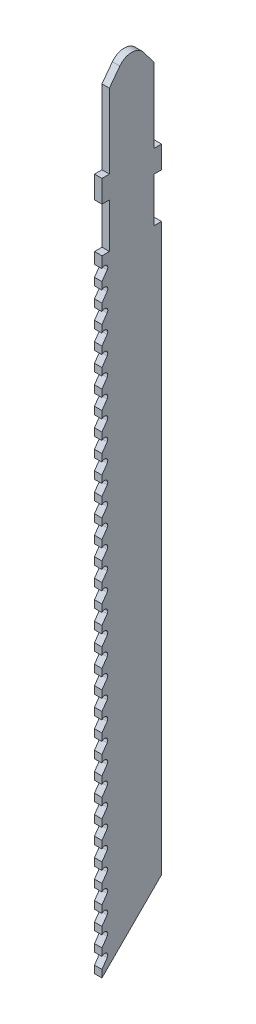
from build123d import *

# Parameters (mm, degrees)
BASE_EXTRUDE_DEPTH      = 0.5
CUT_EXTRUDE1_DEPTH      = 85.096670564
CUT_EXTRUDE1_DEPTH_BACK = 85.096670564
LPATTERN1_COUNT         = 33
LPATTERN1_PITCH         = 2.5


with BuildPart() as part:
    # Sketch1 → Base-Extrude (new, symmetric)
    with BuildSketch(Plane(origin=(0, 0, 0), x_dir=(0, 0, -1), z_dir=(1, 0, 0))):
        with BuildLine():
            Line((3, 0), (3, 6))
            Line((3, 6), (4, 6))
            Line((4, 6), (4, 9))
            Line((4, 9), (3, 9))
            Line((3, 9), (3, 19))
            Line((3, 19), (1.6, 20.866666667))
            ThreePointArc((1.6, 20.866666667), (0, 21.666666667), (-1.6, 20.866666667))
            Line((-1.6, 20.866666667), (-3, 19))
            Line((-3, 19), (-3, 9))
            Line((-3, 9), (-4, 9))
            Line((-4, 9), (-4, 6))
            Line((-4, 6), (-3, 6))
            Line((-3, 6), (-3, 0))
            Line((-3, 0), (-4, 0))
            Line((-4, 0), (-4, -84))
            Line((-4, -84), (4, -76))
            Line((4, -76), (4, 0))
            Line((4, 0), (3, 0))
        make_face()
    extrude(amount=BASE_EXTRUDE_DEPTH, both=True)

    # Sketch3 → Cut-Extrude1 (cut, two sides: drawn at the far end of the back side and taken through both)
    with BuildSketch(Plane(origin=(0, 0, 0), x_dir=(0, 0, -1), z_dir=(1, 0, 0)).offset(-CUT_EXTRUDE1_DEPTH_BACK)):
        with BuildLine():
            Line((-4, -81.5), (-4, -83))
            Line((-4, -83), (-3.295230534, -81.993484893))
            ThreePointArc((-3.295230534, -81.993484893), (-3.400872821, -81.394357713), (-4, -81.5))
        make_face()
    cut_extrude1 = extrude(amount=CUT_EXTRUDE1_DEPTH + CUT_EXTRUDE1_DEPTH_BACK, mode=Mode.SUBTRACT)

    # LPattern1: Cut-Extrude1 ×33
    with Locations(*[(0, i * LPATTERN1_PITCH, 0) for i in range(1, LPATTERN1_COUNT)]):
        add(cut_extrude1, mode=Mode.SUBTRACT)


solid = part.part
